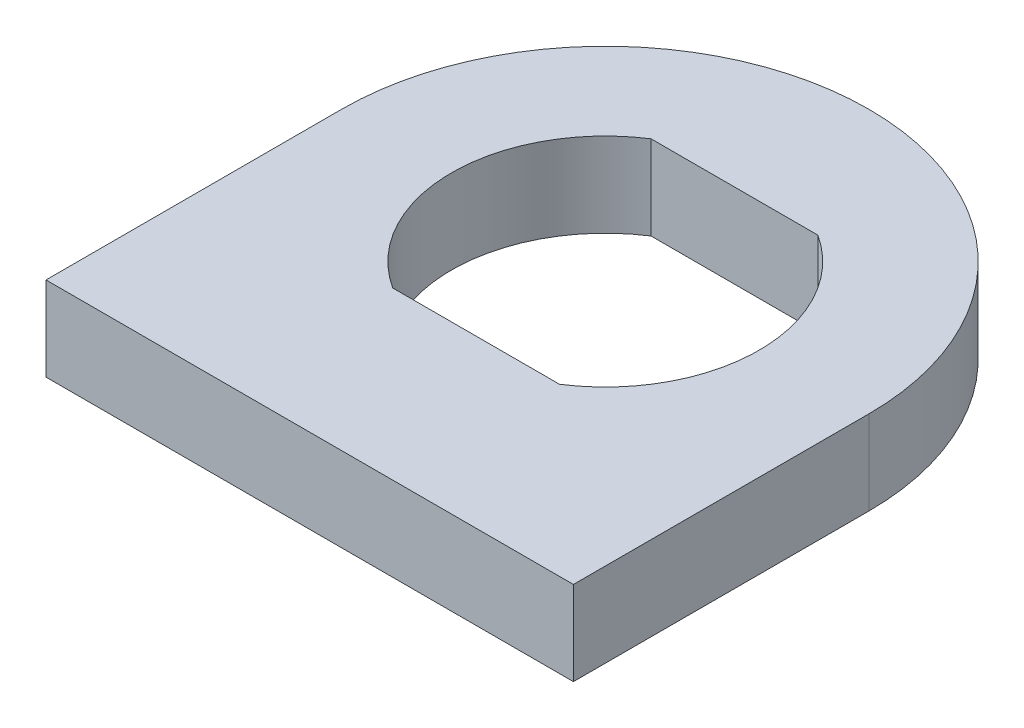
ISO-10303-21;
HEADER;
FILE_DESCRIPTION(('STEP AP214'),'2;1');
FILE_NAME('part.step','',(''),(''),'','','');
FILE_SCHEMA(('AUTOMOTIVE_DESIGN { 1 0 10303 214 1 1 1 1 }'));
ENDSEC;
DATA;
#1=APPLICATION_CONTEXT('core data for automotive mechanical design processes');
#2=APPLICATION_PROTOCOL_DEFINITION('international standard','automotive_design',2000,#1);
#3=PRODUCT_CONTEXT('',#1,'mechanical');
#4=PRODUCT('Part','Part','',(#3));
#5=PRODUCT_RELATED_PRODUCT_CATEGORY('part','',(#4));
#6=PRODUCT_DEFINITION_FORMATION('','',#4);
#7=PRODUCT_DEFINITION_CONTEXT('part definition',#1,'design');
#8=PRODUCT_DEFINITION('design','',#6,#7);
#9=PRODUCT_DEFINITION_SHAPE('','',#8);
#10=(LENGTH_UNIT() NAMED_UNIT(*) SI_UNIT(.MILLI.,.METRE.));
#11=(NAMED_UNIT(*) PLANE_ANGLE_UNIT() SI_UNIT($,.RADIAN.));
#12=(NAMED_UNIT(*) SI_UNIT($,.STERADIAN.) SOLID_ANGLE_UNIT());
#13=UNCERTAINTY_MEASURE_WITH_UNIT(LENGTH_MEASURE(1.E-05),#10,'distance_accuracy_value','');
#14=(GEOMETRIC_REPRESENTATION_CONTEXT(3) GLOBAL_UNCERTAINTY_ASSIGNED_CONTEXT((#13)) GLOBAL_UNIT_ASSIGNED_CONTEXT((#10,
#11,#12)) REPRESENTATION_CONTEXT('',''));
#15=CARTESIAN_POINT('',(0.,0.,0.));
#16=DIRECTION('',(0.,0.,1.));
#17=DIRECTION('',(1.,0.,0.));
#18=AXIS2_PLACEMENT_3D('',#15,#16,#17);
#19=CARTESIAN_POINT('',(-49.4282312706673,1.49837072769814,17.1171269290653));
#20=DIRECTION('',(0.,-1.,0.));
#21=DIRECTION('',(1.,0.,0.));
#22=AXIS2_PLACEMENT_3D('',#19,#20,#21);
#23=PLANE('',#22);
#24=CARTESIAN_POINT('',(-49.4282312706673,1.49837072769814,17.1171269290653));
#25=DIRECTION('',(0.,1.,0.));
#26=DIRECTION('',(0.,0.,1.));
#27=AXIS2_PLACEMENT_3D('',#24,#25,#26);
#28=CIRCLE('',#27,5.79820000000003);
#29=CARTESIAN_POINT('',(-52.5733080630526,1.49837072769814,12.2460269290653));
#30=VERTEX_POINT('',#29);
#31=CARTESIAN_POINT('',(-52.5733080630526,1.49837072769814,21.9882269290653));
#32=VERTEX_POINT('',#31);
#33=EDGE_CURVE('E100',#30,#32,#28,.T.);
#34=ORIENTED_EDGE('',*,*,#33,.T.);
#35=DIRECTION('',(1.,0.,0.));
#36=VECTOR('',#35,1.);
#37=CARTESIAN_POINT('',(-52.5733080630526,1.49837072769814,21.9882269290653));
#38=LINE('',#37,#36);
#39=CARTESIAN_POINT('',(-46.283154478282,1.49837072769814,21.9882269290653));
#40=VERTEX_POINT('',#39);
#41=EDGE_CURVE('E109',#32,#40,#38,.T.);
#42=ORIENTED_EDGE('',*,*,#41,.T.);
#43=CARTESIAN_POINT('',(-49.4282312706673,1.49837072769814,17.1171269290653));
#44=DIRECTION('',(0.,1.,0.));
#45=DIRECTION('',(0.,0.,1.));
#46=AXIS2_PLACEMENT_3D('',#43,#44,#45);
#47=CIRCLE('',#46,5.79820000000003);
#48=CARTESIAN_POINT('',(-46.2831544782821,1.49837072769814,12.2460269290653));
#49=VERTEX_POINT('',#48);
#50=EDGE_CURVE('E48',#40,#49,#47,.T.);
#51=ORIENTED_EDGE('',*,*,#50,.T.);
#52=DIRECTION('',(-1.,0.,0.));
#53=VECTOR('',#52,1.);
#54=CARTESIAN_POINT('',(-46.2831544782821,1.49837072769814,12.2460269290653));
#55=LINE('',#54,#53);
#56=EDGE_CURVE('E106',#49,#30,#55,.T.);
#57=ORIENTED_EDGE('',*,*,#56,.T.);
#58=EDGE_LOOP('',(#34,#42,#51,#57));
#59=FACE_BOUND('',#58,.T.);
#60=DIRECTION('',(-1.,0.,0.));
#61=VECTOR('',#60,1.);
#62=CARTESIAN_POINT('',(-59.3723312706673,1.49837072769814,28.2628048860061));
#63=LINE('',#62,#61);
#64=CARTESIAN_POINT('',(-39.4841312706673,1.49837072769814,28.2628048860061));
#65=VERTEX_POINT('',#64);
#66=CARTESIAN_POINT('',(-59.3723312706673,1.49837072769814,28.2628048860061));
#67=VERTEX_POINT('',#66);
#68=EDGE_CURVE('E134',#65,#67,#63,.T.);
#69=ORIENTED_EDGE('',*,*,#68,.T.);
#70=DIRECTION('',(0.,0.,-1.));
#71=VECTOR('',#70,1.);
#72=CARTESIAN_POINT('',(-59.3723312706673,1.49837072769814,21.9812269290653));
#73=LINE('',#72,#71);
#74=CARTESIAN_POINT('',(-59.3723312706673,1.49837072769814,17.1171269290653));
#75=VERTEX_POINT('',#74);
#76=EDGE_CURVE('E137',#67,#75,#73,.T.);
#77=ORIENTED_EDGE('',*,*,#76,.T.);
#78=CARTESIAN_POINT('',(-49.4282312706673,1.49837072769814,17.1171269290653));
#79=DIRECTION('',(0.,-1.,0.));
#80=DIRECTION('',(1.,0.,0.));
#81=AXIS2_PLACEMENT_3D('',#78,#79,#80);
#82=CIRCLE('',#81,9.9441);
#83=CARTESIAN_POINT('',(-39.4841312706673,1.49837072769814,17.1171269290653));
#84=VERTEX_POINT('',#83);
#85=EDGE_CURVE('E140',#75,#84,#82,.T.);
#86=ORIENTED_EDGE('',*,*,#85,.T.);
#87=DIRECTION('',(0.,0.,1.));
#88=VECTOR('',#87,1.);
#89=CARTESIAN_POINT('',(-39.4841312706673,1.49837072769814,17.1171269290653));
#90=LINE('',#89,#88);
#91=EDGE_CURVE('E142',#84,#65,#90,.T.);
#92=ORIENTED_EDGE('',*,*,#91,.T.);
#93=EDGE_LOOP('',(#69,#77,#86,#92));
#94=FACE_BOUND('',#93,.T.);
#95=ADVANCED_FACE('F33',(#59,#94),#23,.T.);
#96=CARTESIAN_POINT('',(-49.4282312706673,4.67337072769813,17.1171269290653));
#97=DIRECTION('',(0.,-1.,0.));
#98=DIRECTION('',(1.,0.,0.));
#99=AXIS2_PLACEMENT_3D('',#96,#97,#98);
#100=PLANE('',#99);
#101=DIRECTION('',(1.,0.,0.));
#102=VECTOR('',#101,1.);
#103=CARTESIAN_POINT('',(-52.5733080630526,4.67337072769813,21.9882269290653));
#104=LINE('',#103,#102);
#105=CARTESIAN_POINT('',(-52.5733080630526,4.67337072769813,21.9882269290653));
#106=VERTEX_POINT('',#105);
#107=CARTESIAN_POINT('',(-46.283154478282,4.67337072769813,21.9882269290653));
#108=VERTEX_POINT('',#107);
#109=EDGE_CURVE('E124',#106,#108,#104,.T.);
#110=ORIENTED_EDGE('',*,*,#109,.F.);
#111=CARTESIAN_POINT('',(-49.4282312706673,4.67337072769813,17.1171269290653));
#112=DIRECTION('',(0.,1.,0.));
#113=DIRECTION('',(0.,0.,1.));
#114=AXIS2_PLACEMENT_3D('',#111,#112,#113);
#115=CIRCLE('',#114,5.79820000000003);
#116=CARTESIAN_POINT('',(-52.5733080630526,4.67337072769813,12.2460269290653));
#117=VERTEX_POINT('',#116);
#118=EDGE_CURVE('E56',#117,#106,#115,.T.);
#119=ORIENTED_EDGE('',*,*,#118,.F.);
#120=DIRECTION('',(-1.,0.,0.));
#121=VECTOR('',#120,1.);
#122=CARTESIAN_POINT('',(-46.2831544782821,4.67337072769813,12.2460269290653));
#123=LINE('',#122,#121);
#124=CARTESIAN_POINT('',(-46.2831544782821,4.67337072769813,12.2460269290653));
#125=VERTEX_POINT('',#124);
#126=EDGE_CURVE('E115',#125,#117,#123,.T.);
#127=ORIENTED_EDGE('',*,*,#126,.F.);
#128=CARTESIAN_POINT('',(-49.4282312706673,4.67337072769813,17.1171269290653));
#129=DIRECTION('',(0.,1.,0.));
#130=DIRECTION('',(0.,0.,1.));
#131=AXIS2_PLACEMENT_3D('',#128,#129,#130);
#132=CIRCLE('',#131,5.79820000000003);
#133=EDGE_CURVE('E118',#108,#125,#132,.T.);
#134=ORIENTED_EDGE('',*,*,#133,.F.);
#135=EDGE_LOOP('',(#110,#119,#127,#134));
#136=FACE_BOUND('',#135,.T.);
#137=DIRECTION('',(0.,0.,-1.));
#138=VECTOR('',#137,1.);
#139=CARTESIAN_POINT('',(-59.3723312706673,4.67337072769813,17.1171269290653));
#140=LINE('',#139,#138);
#141=CARTESIAN_POINT('',(-59.3723312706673,4.67337072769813,28.2628048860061));
#142=VERTEX_POINT('',#141);
#143=CARTESIAN_POINT('',(-59.3723312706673,4.67337072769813,17.1171269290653));
#144=VERTEX_POINT('',#143);
#145=EDGE_CURVE('E130',#142,#144,#140,.T.);
#146=ORIENTED_EDGE('',*,*,#145,.F.);
#147=DIRECTION('',(-1.,0.,0.));
#148=VECTOR('',#147,1.);
#149=CARTESIAN_POINT('',(-39.4841312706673,4.67337072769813,28.2628048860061));
#150=LINE('',#149,#148);
#151=CARTESIAN_POINT('',(-39.4841312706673,4.67337072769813,28.2628048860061));
#152=VERTEX_POINT('',#151);
#153=EDGE_CURVE('E138',#152,#142,#150,.T.);
#154=ORIENTED_EDGE('',*,*,#153,.F.);
#155=DIRECTION('',(0.,0.,1.));
#156=VECTOR('',#155,1.);
#157=CARTESIAN_POINT('',(-39.4841312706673,4.67337072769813,21.9812269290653));
#158=LINE('',#157,#156);
#159=CARTESIAN_POINT('',(-39.4841312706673,4.67337072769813,17.1171269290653));
#160=VERTEX_POINT('',#159);
#161=EDGE_CURVE('E149',#160,#152,#158,.T.);
#162=ORIENTED_EDGE('',*,*,#161,.F.);
#163=CARTESIAN_POINT('',(-49.4282312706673,4.67337072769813,17.1171269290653));
#164=DIRECTION('',(0.,-1.,0.));
#165=DIRECTION('',(1.,0.,0.));
#166=AXIS2_PLACEMENT_3D('',#163,#164,#165);
#167=CIRCLE('',#166,9.9441);
#168=EDGE_CURVE('E146',#144,#160,#167,.T.);
#169=ORIENTED_EDGE('',*,*,#168,.F.);
#170=EDGE_LOOP('',(#146,#154,#162,#169));
#171=FACE_BOUND('',#170,.T.);
#172=ADVANCED_FACE('F166',(#136,#171),#100,.F.);
#173=CARTESIAN_POINT('',(-59.3723312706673,1.49837072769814,17.1171269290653));
#174=DIRECTION('',(1.,0.,0.));
#175=DIRECTION('',(0.,1.,0.));
#176=AXIS2_PLACEMENT_3D('',#173,#174,#175);
#177=PLANE('',#176);
#178=ORIENTED_EDGE('',*,*,#145,.T.);
#179=DIRECTION('',(0.,1.,0.));
#180=VECTOR('',#179,1.);
#181=CARTESIAN_POINT('',(-59.3723312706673,1.49837072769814,17.1171269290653));
#182=LINE('',#181,#180);
#183=EDGE_CURVE('E41',#75,#144,#182,.T.);
#184=ORIENTED_EDGE('',*,*,#183,.F.);
#185=ORIENTED_EDGE('',*,*,#76,.F.);
#186=DIRECTION('',(0.,1.,0.));
#187=VECTOR('',#186,1.);
#188=CARTESIAN_POINT('',(-59.3723312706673,1.49837072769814,28.2628048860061));
#189=LINE('',#188,#187);
#190=EDGE_CURVE('E11',#67,#142,#189,.T.);
#191=ORIENTED_EDGE('',*,*,#190,.T.);
#192=EDGE_LOOP('',(#178,#184,#185,#191));
#193=FACE_BOUND('',#192,.T.);
#194=ADVANCED_FACE('F35',(#193),#177,.F.);
#195=CARTESIAN_POINT('',(-49.4282312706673,1.49837072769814,17.1171269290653));
#196=DIRECTION('',(0.,1.,0.));
#197=DIRECTION('',(-1.,0.,0.));
#198=AXIS2_PLACEMENT_3D('',#195,#196,#197);
#199=CYLINDRICAL_SURFACE('',#198,9.9441);
#200=ORIENTED_EDGE('',*,*,#168,.T.);
#201=DIRECTION('',(0.,1.,0.));
#202=VECTOR('',#201,1.);
#203=CARTESIAN_POINT('',(-39.4841312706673,1.49837072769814,17.1171269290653));
#204=LINE('',#203,#202);
#205=EDGE_CURVE('E155',#84,#160,#204,.T.);
#206=ORIENTED_EDGE('',*,*,#205,.F.);
#207=ORIENTED_EDGE('',*,*,#85,.F.);
#208=ORIENTED_EDGE('',*,*,#183,.T.);
#209=EDGE_LOOP('',(#200,#206,#207,#208));
#210=FACE_BOUND('',#209,.T.);
#211=ADVANCED_FACE('F162',(#210),#199,.T.);
#212=CARTESIAN_POINT('',(-39.4841312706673,1.49837072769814,21.9812269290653));
#213=DIRECTION('',(-1.,0.,0.));
#214=DIRECTION('',(0.,0.,1.));
#215=AXIS2_PLACEMENT_3D('',#212,#213,#214);
#216=PLANE('',#215);
#217=ORIENTED_EDGE('',*,*,#161,.T.);
#218=DIRECTION('',(0.,1.,0.));
#219=VECTOR('',#218,1.);
#220=CARTESIAN_POINT('',(-39.4841312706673,1.49837072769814,28.2628048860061));
#221=LINE('',#220,#219);
#222=EDGE_CURVE('E144',#65,#152,#221,.T.);
#223=ORIENTED_EDGE('',*,*,#222,.F.);
#224=ORIENTED_EDGE('',*,*,#91,.F.);
#225=ORIENTED_EDGE('',*,*,#205,.T.);
#226=EDGE_LOOP('',(#217,#223,#224,#225));
#227=FACE_BOUND('',#226,.T.);
#228=ADVANCED_FACE('F170',(#227),#216,.F.);
#229=CARTESIAN_POINT('',(-39.4841312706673,1.49837072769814,28.2628048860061));
#230=DIRECTION('',(0.,0.,-1.));
#231=DIRECTION('',(-1.,0.,0.));
#232=AXIS2_PLACEMENT_3D('',#229,#230,#231);
#233=PLANE('',#232);
#234=ORIENTED_EDGE('',*,*,#153,.T.);
#235=ORIENTED_EDGE('',*,*,#190,.F.);
#236=ORIENTED_EDGE('',*,*,#68,.F.);
#237=ORIENTED_EDGE('',*,*,#222,.T.);
#238=EDGE_LOOP('',(#234,#235,#236,#237));
#239=FACE_BOUND('',#238,.T.);
#240=ADVANCED_FACE('F174',(#239),#233,.F.);
#241=CARTESIAN_POINT('',(-49.4282312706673,1.49837072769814,17.1171269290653));
#242=DIRECTION('',(0.,1.,0.));
#243=DIRECTION('',(0.,0.,1.));
#244=AXIS2_PLACEMENT_3D('',#241,#242,#243);
#245=CYLINDRICAL_SURFACE('',#244,5.79820000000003);
#246=ORIENTED_EDGE('',*,*,#118,.T.);
#247=DIRECTION('',(0.,1.,0.));
#248=VECTOR('',#247,1.);
#249=CARTESIAN_POINT('',(-52.5733080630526,1.49837072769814,21.9882269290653));
#250=LINE('',#249,#248);
#251=EDGE_CURVE('E96',#32,#106,#250,.T.);
#252=ORIENTED_EDGE('',*,*,#251,.F.);
#253=ORIENTED_EDGE('',*,*,#33,.F.);
#254=DIRECTION('',(0.,1.,0.));
#255=VECTOR('',#254,1.);
#256=CARTESIAN_POINT('',(-52.5733080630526,1.49837072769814,12.2460269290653));
#257=LINE('',#256,#255);
#258=EDGE_CURVE('E128',#30,#117,#257,.T.);
#259=ORIENTED_EDGE('',*,*,#258,.T.);
#260=EDGE_LOOP('',(#246,#252,#253,#259));
#261=FACE_BOUND('',#260,.T.);
#262=ADVANCED_FACE('F98',(#261),#245,.F.);
#263=CARTESIAN_POINT('',(-46.2831544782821,1.49837072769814,12.2460269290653));
#264=DIRECTION('',(0.,0.,-1.));
#265=DIRECTION('',(-1.,0.,0.));
#266=AXIS2_PLACEMENT_3D('',#263,#264,#265);
#267=PLANE('',#266);
#268=ORIENTED_EDGE('',*,*,#126,.T.);
#269=ORIENTED_EDGE('',*,*,#258,.F.);
#270=ORIENTED_EDGE('',*,*,#56,.F.);
#271=DIRECTION('',(0.,1.,0.));
#272=VECTOR('',#271,1.);
#273=CARTESIAN_POINT('',(-46.2831544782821,1.49837072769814,12.2460269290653));
#274=LINE('',#273,#272);
#275=EDGE_CURVE('E131',#49,#125,#274,.T.);
#276=ORIENTED_EDGE('',*,*,#275,.T.);
#277=EDGE_LOOP('',(#268,#269,#270,#276));
#278=FACE_BOUND('',#277,.T.);
#279=ADVANCED_FACE('F207',(#278),#267,.F.);
#280=CARTESIAN_POINT('',(-49.4282312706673,1.49837072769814,17.1171269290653));
#281=DIRECTION('',(0.,1.,0.));
#282=DIRECTION('',(0.,0.,1.));
#283=AXIS2_PLACEMENT_3D('',#280,#281,#282);
#284=CYLINDRICAL_SURFACE('',#283,5.79820000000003);
#285=ORIENTED_EDGE('',*,*,#133,.T.);
#286=ORIENTED_EDGE('',*,*,#275,.F.);
#287=ORIENTED_EDGE('',*,*,#50,.F.);
#288=DIRECTION('',(0.,1.,0.));
#289=VECTOR('',#288,1.);
#290=CARTESIAN_POINT('',(-46.283154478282,1.49837072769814,21.9882269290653));
#291=LINE('',#290,#289);
#292=EDGE_CURVE('E105',#40,#108,#291,.T.);
#293=ORIENTED_EDGE('',*,*,#292,.T.);
#294=EDGE_LOOP('',(#285,#286,#287,#293));
#295=FACE_BOUND('',#294,.T.);
#296=ADVANCED_FACE('F214',(#295),#284,.F.);
#297=CARTESIAN_POINT('',(-52.5733080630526,1.49837072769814,21.9882269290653));
#298=DIRECTION('',(0.,0.,1.));
#299=DIRECTION('',(1.,0.,0.));
#300=AXIS2_PLACEMENT_3D('',#297,#298,#299);
#301=PLANE('',#300);
#302=ORIENTED_EDGE('',*,*,#109,.T.);
#303=ORIENTED_EDGE('',*,*,#292,.F.);
#304=ORIENTED_EDGE('',*,*,#41,.F.);
#305=ORIENTED_EDGE('',*,*,#251,.T.);
#306=EDGE_LOOP('',(#302,#303,#304,#305));
#307=FACE_BOUND('',#306,.T.);
#308=ADVANCED_FACE('F110',(#307),#301,.F.);
#309=CLOSED_SHELL('',(#95,#172,#194,#211,#228,#240,#262,#279,#296,#308));
#310=MANIFOLD_SOLID_BREP('B2',#309);
#311=ADVANCED_BREP_SHAPE_REPRESENTATION('',(#18,#310),#14);
#312=SHAPE_DEFINITION_REPRESENTATION(#9,#311);
ENDSEC;
END-ISO-10303-21;
